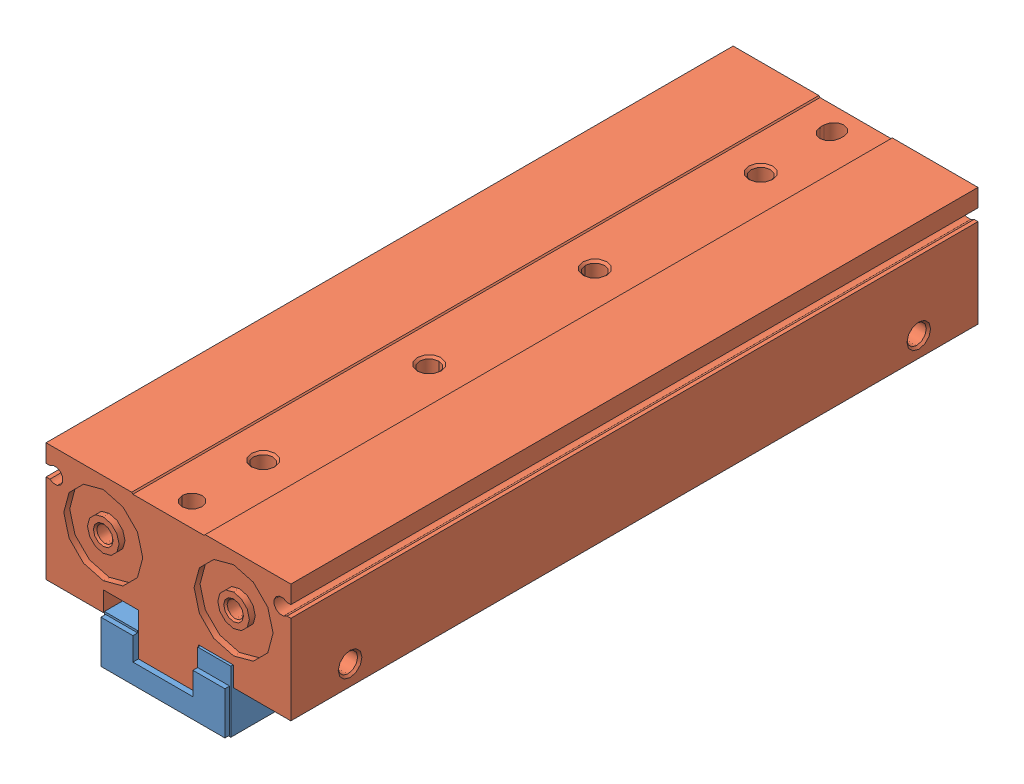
SolidWorks assembly SHF20-80D.sldasm, configuration Default (file format 11000). Lengths in mm.
Overall size (62 41 176.8).
3 component instances, 2 part files, 0 mates.
Components (placement in the parent):
- SHF20-8002-1: SHF20-8002.sldprt [Default] at (0 -41 -40) x (-1 0 0) z (0 0 -1) size (32 17.6 115.2)
- SHF20-8002-2: SHF20-8002.sldprt [Default] at (0 -41 40) size (32 17.6 115.2)
- SHF20-8001-1: SHF20-8001.sldprt [Default] at origin size (62 35.7 174)
